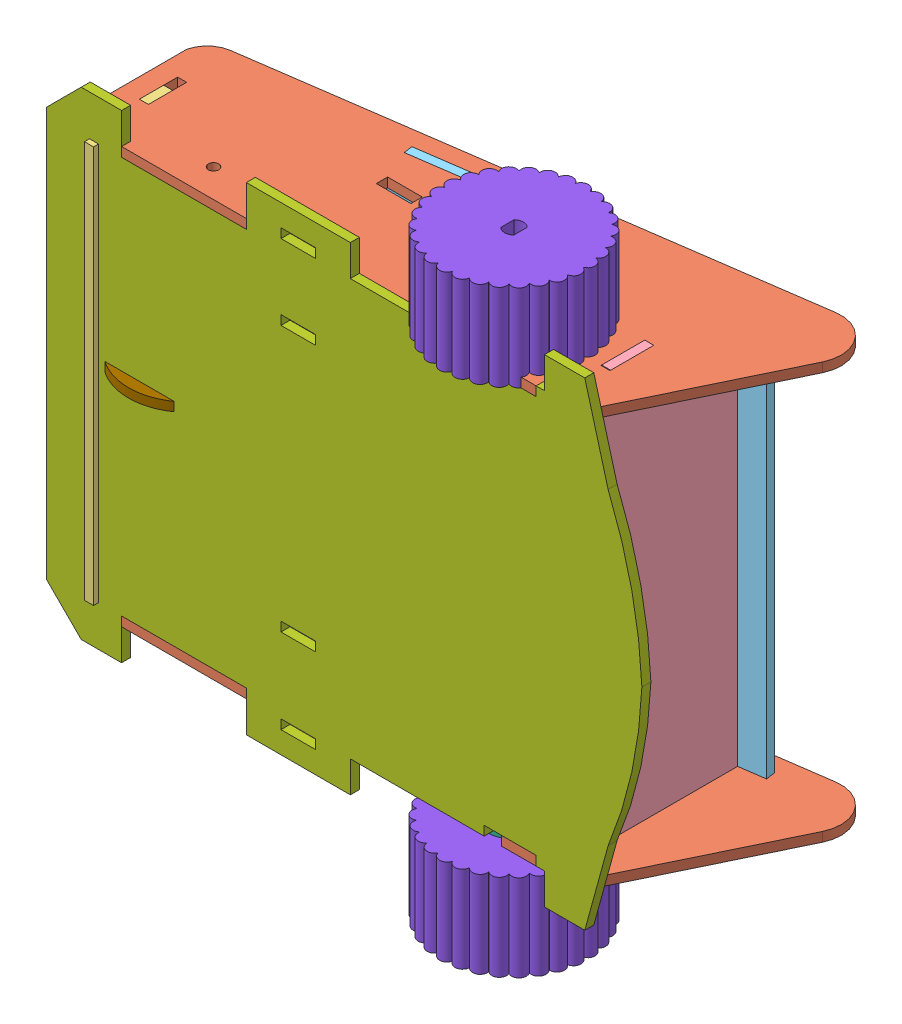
SolidWorks assembly Ensamblaje dos.SLDASM, configuration Predeterminado (file format 10000). Lengths in mm.
Overall size (177.6 172.4 69).
14 component instances, 9 part files, 35 mates.
Components (placement in the parent):
- 01.- Motor-1: 01.- Motor.SLDPRT [Predeterminado] at (74.1429 18.5018 83.8143) x (0 -1 0) z (0 0 1) size (37 64 23)
- 01.- Motor-3: 01.- Motor.SLDPRT [Predeterminado] at (74.1429 -77.0982 83.8143) x (0 -1 0) z (0 0 1) size (37 64 23)
- 03.-lateral-1: 03.-lateral.SLDPRT [Predeterminado] at (12.016 -89.0901 81.9315) x (1 0 0) z (0 1 0) size (170.84 61.64 2.7)
- 03.-lateral-2: 03.-lateral.SLDPRT [Predeterminado] at (12.016 28.2099 81.9315) x (1 0 0) z (0 1 0) size (170.84 61.64 2.7)
- 05.- frontal-1: 05.- frontal.SLDPRT [Predeterminado] at (-15.0227 -38.3402 98.3926) x (0 -1 0) z (-1 0 0) size (120 32.25 2.6)
- 04.- trasero-1: 04.- trasero.SLDPRT [Predeterminado] at (118.0699 -41.8269 85.841) x (0 -1 0) z (-1 0 0) size (120 49.12 2.6)
- capo 1-1: capo 1.SLDPRT [Predeterminado] at (22.7829 -46.9145 69.1113) x (0.989958 0 -0.141361) z (0.141361 0 0.989958) size (141.84 120 2.6)
- 07.- rueda 1-1: 07.- rueda 1.SLDPRT [Predeterminado] at (74.1429 -86.3901 83.8143) x (0 0 -1) z (0 -1 0) size (15.4 13.78 2.6)
- 07.- rueda 1-2: 07.- rueda 1.SLDPRT [Predeterminado] at (74.1429 -88.9901 83.8143) x (0 0 -1) z (0 -1 0) size (15.4 13.78 2.6)
- 07.- rueda 1-3: 07.- rueda 1.SLDPRT [Predeterminado] at (107.3217 -94.1901 83.8143) x (0 0 -1) z (0 1 0) size (15.4 13.78 2.6)
- 02.- Base vehiculo-2: 02.- Base vehiculo.SLDPRT [Predeterminado] at (64.5044 -20.2038 106.8143) x (0 -1 0) z (0 0 1) size (138 171.76 2.6)
- rueda dos-1: rueda dos.SLDPRT [Predeterminado] at (90.7323 -119.1901 95.3143) x (0 0 -1) z (0 1 0) size (42.92 42.71 25)
- 08.- solita-1: 08.- solita.SLDPRT [Predeterminado] at (-0.1987 -27.7901 134.297) x (1 0 0) z (0 1 0) size (20 5.75 2.6)
- rueda dos-4: rueda dos.SLDPRT [Predeterminado] at (90.7323 28.2099 95.3143) x (0 0 -1) z (0 1 0) size (42.92 42.71 25)
Mates (geometry in assembly coordinates):
- Coincidente9: coincident anti-aligned: plane of 01.- Motor-1 through (74.1429 18.5018 83.8143) normal (0 0 -1); plane of 03.-lateral-1 through (71.9273 -86.3901 83.8143) normal (0 0 1)
- Coincidente18: coincident anti-aligned: plane of 03.-lateral-1 through (137.5765 -86.3901 57.77) normal (0 1 0); plane of 05.- frontal-1 through (-17.6227 -86.3901 98.3926) normal (0 -1 0)
- Coincidente20: coincident anti-aligned: plane of 01.- Motor-3 through (37.2323 -86.3901 106.8143) normal (0 -1 0); plane of 03.-lateral-1 through (137.5765 -86.3901 57.77) normal (0 1 0)
- Coincidente25: coincident anti-aligned: plane of 03.-lateral-1 through (137.5765 -86.3901 57.77) normal (0 1 0); plane of 04.- trasero-1 through (115.4699 -86.3901 106.6078) normal (0 -1 0)
- Coincidente28: coincident anti-aligned: plane of 03.-lateral-1 through (137.5765 -86.3901 57.77) normal (0 1 0); plane of capo 1-1 through (101.1984 -86.3901 60.5403) normal (0 -1 0)
- Coincidente29: coincident anti-aligned: plane of 03.-lateral-1 through (115.4699 -86.3901 82.3143) normal (1 0 0); plane of 04.- trasero-1 through (115.4699 -41.8269 85.841) normal (-1 0 0)
- Coincidente30: coincident anti-aligned: plane of 03.-lateral-1 through (83.4162 -86.3901 63.0795) normal (-0.141361 0 -0.989958); plane of capo 1-1 through (23.1504 -46.9145 71.6851) normal (0.141361 0 0.989958)
- Coincidente31: coincident: plane of 05.- frontal-1 through (-15.0227 -38.3402 98.3926) normal (1 0 0); line of capo 1-1 through (-15.0227 28.2099 77.1361) axis (0 -1 0)
- Coincidente32: coincident anti-aligned: plane of 01.- Motor-3 through (37.2323 -86.3901 106.8143) normal (0 -1 0); plane of 07.- rueda 1-1 through (90.7323 -86.3901 95.3143) normal (0 1 0)
- Concéntrica1: concentric aligned: cylinder of 01.- Motor-3 through (90.7323 -95.3901 95.3143) axis (0 1 0) radius 2.7; cylinder of 07.- rueda 1-1 through (90.7323 -88.9901 95.3143) axis (0 1 0) radius 2.7
- Coincidente33: coincident anti-aligned: plane of 01.- Motor-3 through (92.6223 -95.3901 97.2425) normal (1 0 0); plane of 07.- rueda 1-1 through (92.6223 -88.9901 97.2425) normal (-1 0 0)
- Coincidente35: coincident anti-aligned: plane of 07.- rueda 1-1 through (90.7323 -88.9901 95.3143) normal (0 -1 0); plane of 07.- rueda 1-2 through (90.7323 -88.9901 95.3143) normal (0 1 0)
- Coincidente36: coincident aligned: plane of 07.- rueda 1-1 through (97.6223 -88.9901 98.752) normal (1 0 0); plane of 07.- rueda 1-2 through (97.6223 -91.5901 98.752) normal (1 0 0)
- Concéntrica2: concentric aligned: cylinder of 07.- rueda 1-1 through (90.7323 -88.9901 95.3143) axis (0 1 0) radius 7.7; cylinder of 07.- rueda 1-2 through (90.7323 -91.5901 95.3143) axis (0 1 0) radius 7.7
- Concéntrica3: concentric anti-aligned: cylinder of 07.- rueda 1-2 through (90.7323 -91.5901 95.3143) axis (0 1 0) radius 7.7; cylinder of 07.- rueda 1-3 through (90.7323 -91.5901 95.3143) axis (0 -1 0) radius 7.7
- Coincidente37: coincident aligned: plane of 07.- rueda 1-2 through (97.6223 -91.5901 98.752) normal (1 0 0); plane of 07.- rueda 1-3 through (97.6223 -91.5901 98.752) normal (1 0 0)
- Coincidente38: coincident anti-aligned: plane of 07.- rueda 1-2 through (90.7323 -91.5901 95.3143) normal (0 -1 0); plane of 07.- rueda 1-3 through (90.7323 -91.5901 95.3143) normal (0 1 0)
- Coincidente41: coincident aligned: plane of 03.-lateral-2 through (-8.3777 30.9099 109.4143) normal (0 0 1); plane of 02.- Base vehiculo-2 through (12.3193 -24.0896 109.4143) normal (0 0 1)
- Coincidente42: coincident anti-aligned: plane of 03.-lateral-2 through (27.6223 30.9099 106.8143) normal (1 0 0); plane of 02.- Base vehiculo-2 through (27.6223 28.2099 109.4143) normal (-1 0 0)
- Coincidente43: coincident anti-aligned: plane of 03.-lateral-2 through (137.5765 28.2099 57.77) normal (0 -1 0); plane of 02.- Base vehiculo-2 through (-8.3777 28.2099 109.4143) normal (0 1 0)
- Coincidente44: coincident anti-aligned: plane of 03.-lateral-1 through (137.5765 -86.3901 57.77) normal (0 1 0); plane of 02.- Base vehiculo-2 through (-8.3777 -86.3901 109.4143) normal (0 -1 0)
- Coincidente45: coincident anti-aligned: plane of 03.-lateral-1 through (27.6223 -86.3901 106.8143) normal (1 0 0); plane of 02.- Base vehiculo-2 through (27.6223 -86.3901 109.4143) normal (-1 0 0)
- Coincidente46: coincident anti-aligned: plane of 03.-lateral-1 through (32.2323 -86.3901 106.8143) normal (0 0 1); plane of 02.- Base vehiculo-2 through (12.3193 -24.0896 106.8143) normal (0 0 -1)
- Concéntrica4: concentric anti-aligned: cylinder of 01.- Motor-3 through (90.7323 -95.3901 95.3143) axis (0 1 0) radius 2.7; cylinder of rueda dos-1 through (90.7323 -94.1901 95.3143) axis (0 -1 0) radius 2.7
- Coincidente48: coincident anti-aligned: plane of 01.- Motor-3 through (92.6223 -95.3901 97.2425) normal (1 0 0); plane of rueda dos-1 through (92.6223 -94.1901 97.2425) normal (-1 0 0)
- Coincidente50: coincident anti-aligned: plane of 03.-lateral-1 through (-17.6227 -86.3901 83.9917) normal (1 0 0); plane of 05.- frontal-1 through (-17.6227 -38.3402 98.3926) normal (-1 0 0)
- Distancia2: distance = 70.3 mm aligned: plane of 08.- solita-1 through (-3.211 -27.7901 95.1415) normal (0 -1 0); plane of 02.- Base vehiculo-2 through (-20.0227 -98.0901 109.4143) normal (0 -1 0)
- Coincidente52: coincident anti-aligned: plane of 01.- Motor-3 through (74.1429 -77.0982 106.8143) normal (0 0 1); plane of 02.- Base vehiculo-2 through (12.3193 -24.0896 106.8143) normal (0 0 -1)
- Coincidente54: coincident anti-aligned: plane of 07.- rueda 1-3 through (90.7323 -94.1901 95.3143) normal (0 -1 0); plane of rueda dos-1 through (81.1323 -94.1901 94.3144) normal (0 1 0)
- Coincidente55: coincident anti-aligned: plane of 01.- Motor-3 through (101.2323 -67.3901 106.8143) normal (1 0 0); plane of 03.-lateral-1 through (101.2323 -86.3901 88.8143) normal (-1 0 0)
- Coincidente58: coincident anti-aligned: plane of 01.- Motor-1 through (101.2323 28.2099 106.8143) normal (1 0 0); plane of 03.-lateral-2 through (101.2323 30.9099 88.8143) normal (-1 0 0)
- Coincidente59: coincident anti-aligned: plane of 01.- Motor-1 through (37.2323 28.2099 106.8143) normal (0 1 0); plane of 03.-lateral-2 through (137.5765 28.2099 57.77) normal (0 -1 0)
- Coincidente60: coincident anti-aligned: plane of 01.- Motor-1 through (37.2323 28.2099 106.8143) normal (0 1 0); plane of rueda dos-4 through (81.1323 28.2099 94.3144) normal (0 -1 0)
- Concéntrica5: concentric aligned: cylinder of 01.- Motor-1 through (90.7323 37.2099 95.3143) axis (0 -1 0) radius 2.7; cylinder of rueda dos-4 through (90.7323 53.2099 95.3143) axis (0 -1 0) radius 2.7
- Coincidente61: coincident anti-aligned: plane of 01.- Motor-1 through (92.6223 37.2099 97.2425) normal (1 0 0); plane of rueda dos-4 through (92.6223 53.2099 97.2425) normal (-1 0 0)
